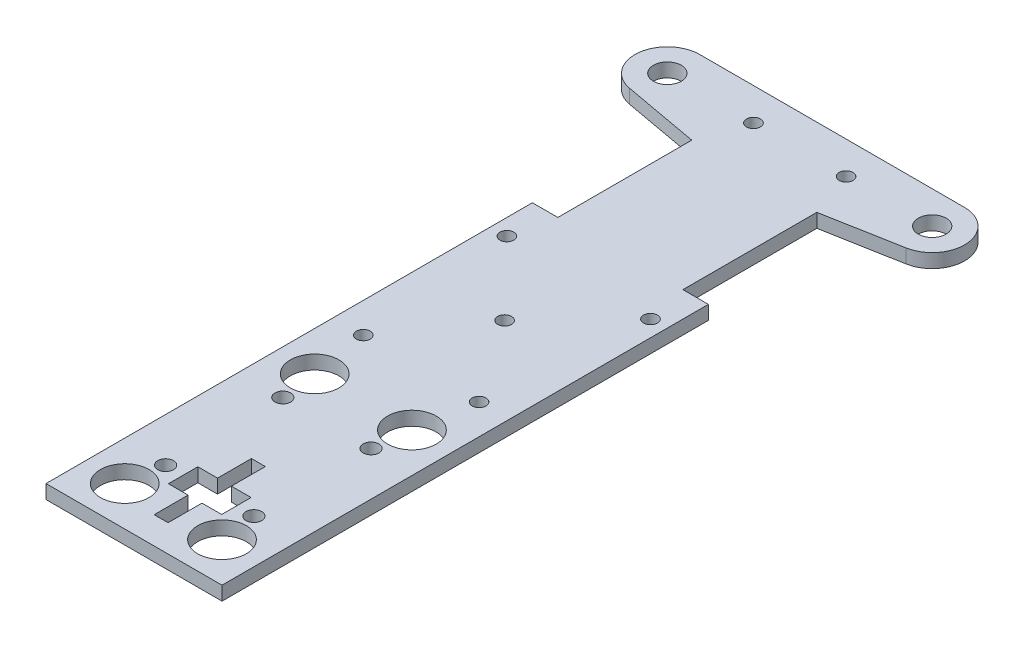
from build123d import *

# Parameters (mm, degrees)
CROQUIS1_W                 = 32
CROQUIS1_H                 = 52
CROQUIS1_R                 = 4
SALIENTE_EXTRUIR1_DEPTH    = 3
CROQUIS2_W                 = 32
CROQUIS2_H                 = 3
SALIENTE_EXTRUIR2_DEPTH    = 50
CORTAR_EXTRUIR1_DEPTH      = 107.943910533
CORTAR_EXTRUIR1_DEPTH_BACK = 107.943910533
CROQUIS3_W                 = 11.5
CROQUIS3_H                 = 6.35
CORTAR_EXTRUIR2_DEPTH      = 107.943910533
CORTAR_EXTRUIR2_DEPTH_BACK = 107.943910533
CROQUIS4_R                 = 1.7
CORTAR_EXTRUIR3_DEPTH      = 107.943910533
CORTAR_EXTRUIR3_DEPTH_BACK = 107.943910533
CROQUIS5_W                 = 3
CROQUIS5_H                 = 21
CORTAR_EXTRUIR4_DEPTH      = 107.943910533
CORTAR_EXTRUIR4_DEPTH_BACK = 107.943910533
CROQUIS6_R                 = 1.7
CORTAR_EXTRUIR5_DEPTH      = 107.943910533
CORTAR_EXTRUIR5_DEPTH_BACK = 107.943910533
CROQUIS7_R                 = 1.5
CROQUIS8_W                 = 49
CROQUIS8_H                 = 3
SALIENTE_EXTRUIR3_DEPTH    = 3
CROQUIS9_W                 = 27
CROQUIS9_H                 = 25
SALIENTE_EXTRUIR4_DEPTH    = 3
CROQUIS10_R                = 3.000000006
CROQUIS10_R_2              = 3
SALIENTE_EXTRUIR5_DEPTH    = 3
CORTAR_EXTRUIR6_DEPTH      = 154.996132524
CORTAR_EXTRUIR6_DEPTH_BACK = 154.996132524
CROQUIS12_R                = 1.5
SALIENTE_EXTRUIR6_START    = -3
CROQUIS14_R                = 3.000000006
CROQUIS14_R_2              = 3
SALIENTE_EXTRUIR6_DEPTH    = 3
CORTAR_EXTRUIR7_DEPTH      = 157.537789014
CORTAR_EXTRUIR7_DEPTH_BACK = 157.537789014
CROQUIS15_R                = 1.5
CROQUIS16_W                = 3
CROQUIS16_H                = 3
SALIENTE_EXTRUIR7_DEPTH    = 56
CROQUIS17_W                = 32
CROQUIS17_H                = 3
SALIENTE_EXTRUIR8_DEPTH    = 3
CORTAR_EXTRUIR8_DEPTH      = 157.537789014
CORTAR_EXTRUIR8_DEPTH_BACK = 157.537789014
CROQUIS18_R                = 5.25


with BuildPart() as part:
    # Croquis1 → Saliente-Extruir1 (new body)
    with BuildSketch(Plane(origin=(0, 0, 0), x_dir=(1, 0, 0), z_dir=(0, 1, 0))):
        with Locations((16, 26)):
            Rectangle(CROQUIS1_W, CROQUIS1_H)
        with Locations(Location((26.5, 46.5, 0), (0, 0, 270))):
            Circle(CROQUIS1_R, mode=Mode.SUBTRACT)
        with Locations(Location((26.5, 5.5, 0), (0, 0, 270))):
            Circle(CROQUIS1_R, mode=Mode.SUBTRACT)
        with Locations(Location((5.5, 5.5, 0), (0, 0, 90))):
            Circle(CROQUIS1_R, mode=Mode.SUBTRACT)
        with Locations(Location((5.5, 46.5, 0), (0, 0, 90))):
            Circle(CROQUIS1_R, mode=Mode.SUBTRACT)
    extrude(amount=SALIENTE_EXTRUIR1_DEPTH)

    # Croquis2 → Saliente-Extruir2 (add)
    with BuildSketch(Plane(origin=(0, 0, -52), x_dir=(-1, 0, 0), z_dir=(0, 0, -1))):
        with Locations((-16, 1.5)):
            Rectangle(CROQUIS2_W, CROQUIS2_H)
    extrude(amount=SALIENTE_EXTRUIR2_DEPTH)

    # Croquis3 → Cortar-Extruir1 (cut, two sides: drawn at the far end of the back side and taken through both)
    with BuildSketch(Plane(origin=(0, 3, 0), x_dir=(1, 0, 0), z_dir=(0, 1, 0)).offset(-CORTAR_EXTRUIR1_DEPTH_BACK)):
        with Locations((16, 13.352394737)):
            Rectangle(CROQUIS3_W, CROQUIS3_H)
    extrude(amount=CORTAR_EXTRUIR1_DEPTH + CORTAR_EXTRUIR1_DEPTH_BACK, mode=Mode.SUBTRACT)

    # Croquis4 → Cortar-Extruir2 (cut, two sides: drawn at the far end of the back side and taken through both)
    with BuildSketch(Plane.XZ.offset(-CORTAR_EXTRUIR2_DEPTH_BACK)):
        with Locations(Location((25.525, -13.352394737, 0), (0, 0, 270))):
            Circle(CROQUIS4_R)
        with Locations(Location((6.475, -13.352394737, 0), (0, 0, 270))):
            Circle(CROQUIS4_R)
    extrude(amount=CORTAR_EXTRUIR2_DEPTH + CORTAR_EXTRUIR2_DEPTH_BACK, mode=Mode.SUBTRACT)

    # Croquis5 → Cortar-Extruir3 (cut, two sides: drawn at the far end of the back side and taken through both)
    with BuildSketch(Plane(origin=(0, 3, 0), x_dir=(1, 0, 0), z_dir=(0, 1, 0)).offset(-CORTAR_EXTRUIR3_DEPTH_BACK)):
        with Locations((16, 13.352394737)):
            Rectangle(CROQUIS5_W, CROQUIS5_H)
    extrude(amount=CORTAR_EXTRUIR3_DEPTH + CORTAR_EXTRUIR3_DEPTH_BACK, mode=Mode.SUBTRACT)

    # Croquis6 → Cortar-Extruir4 (cut, two sides: drawn at the far end of the back side and taken through both)
    with BuildSketch(Plane(origin=(0, 3, 0), x_dir=(1, 0, 0), z_dir=(0, 1, 0)).offset(-CORTAR_EXTRUIR4_DEPTH_BACK)):
        with Locations(Location((25.525, 13.352394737, 0), (0, 0, 90))):
            Circle(CROQUIS6_R)
        with Locations(Location((6.475, 13.352394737, 0), (0, 0, 90))):
            Circle(CROQUIS6_R)
        with Locations(Location((25.525, 38.647605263, 0), (0, 0, 270))):
            Circle(CROQUIS6_R)
        with Locations(Location((6.475, 38.647605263, 0), (0, 0, 270))):
            Circle(CROQUIS6_R)
    extrude(amount=CORTAR_EXTRUIR4_DEPTH + CORTAR_EXTRUIR4_DEPTH_BACK, mode=Mode.SUBTRACT)

    # Croquis7 → Cortar-Extruir5 (cut, two sides: drawn at the far end of the back side and taken through both)
    with BuildSketch(Plane(origin=(0, 3, 0), x_dir=(1, 0, 0), z_dir=(0, 1, 0)).offset(-CORTAR_EXTRUIR5_DEPTH_BACK)):
        with Locations(Location((3.5, 59, 0), (0, 0, 270))):
            Circle(CROQUIS7_R)
        with Locations(Location((28.5, 59, 0), (0, 0, 270))):
            Circle(CROQUIS7_R)
    extrude(amount=CORTAR_EXTRUIR5_DEPTH + CORTAR_EXTRUIR5_DEPTH_BACK, mode=Mode.SUBTRACT)

    # Croquis8 → Saliente-Extruir3 (add)
    with BuildSketch(Plane.ZY):
        with Locations((-77.5, 1.5)):
            Rectangle(CROQUIS8_W, CROQUIS8_H)
    saliente_extruir3 = extrude(amount=SALIENTE_EXTRUIR3_DEPTH)

    # Simetr_a1: Saliente-Extruir3 across plane
    add(saliente_extruir3.mirror(Plane.ZY.offset(-16)))

    # Croquis9 → Saliente-Extruir4 (add)
    with BuildSketch(Plane(origin=(0, 3, 0), x_dir=(1, 0, 0), z_dir=(0, 1, 0))):
        with Locations((16, 114.5)):
            Rectangle(CROQUIS9_W, CROQUIS9_H)
    extrude(amount=-SALIENTE_EXTRUIR4_DEPTH)

    # Croquis10 → Saliente-Extruir5 (add)
    with BuildSketch(Plane.XZ):
        with BuildLine():
            Line((29.5, -127), (29.5, -132.944094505))
            Line((29.5, -132.944094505), (45.437901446, -135.861859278))
            ThreePointArc((45.437901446, -135.861859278), (49.488364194, -141.479445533), (44.040412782, -145.755348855))
            Line((44.040412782, -145.755348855), (-12.637680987, -145.780120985))
            ThreePointArc((-12.637680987, -145.780120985), (-17.619387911, -141.232189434), (-13.538149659, -135.861474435))
            Line((-13.538149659, -135.861474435), (2.5, -132.925754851))
            Line((2.5, -132.925754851), (2.5, -127))
            Line((2.5, -127), (29.5, -127))
        make_face()
        with Locations(Location((-12.639866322, -140.780121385, 0), (0, 0, 270))):
            Circle(CROQUIS10_R, mode=Mode.SUBTRACT)
        with Locations(Location((44.53751123, -140.780120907, 0), (0, 0, 270))):
            Circle(CROQUIS10_R_2, mode=Mode.SUBTRACT)
    extrude(amount=-SALIENTE_EXTRUIR5_DEPTH)

    # Croquis12 → Cortar-Extruir6 (cut, two sides: drawn at the far end of the back side and taken through both)
    with BuildSketch(Plane(origin=(0, 3, 0), x_dir=(1, 0, 0), z_dir=(0, 1, 0)).offset(-CORTAR_EXTRUIR6_DEPTH_BACK)):
        with Locations(Location((31.5, 93, 0), (0, 0, 270))):
            Circle(CROQUIS12_R)
        with Locations(Location((16, 77, 0), (0, 0, 270))):
            Circle(CROQUIS12_R)
        with Locations(Location((0.5, 93, 0), (0, 0, 270))):
            Circle(CROQUIS12_R)
    extrude(amount=CORTAR_EXTRUIR6_DEPTH + CORTAR_EXTRUIR6_DEPTH_BACK, mode=Mode.SUBTRACT)

    # Croquis14 → Saliente-Extruir6 (add)
    with BuildSketch(Plane(origin=(0, 3, 0), x_dir=(1, 0, 0), z_dir=(0, 1, 0)).offset(SALIENTE_EXTRUIR6_START)):
        with BuildLine():
            Line((-12.639866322, 147.780121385), (44.53751123, 147.780121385))
            ThreePointArc((44.53751123, 147.780121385), (51.508844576, 141.412985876), (45.798057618, 133.894554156))
            Line((45.798057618, 133.894554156), (29.5, 130.910855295))
            Line((29.5, 130.910855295), (2.5, 130.910855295))
            Line((2.5, 130.910855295), (-13.892796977, 133.893165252))
            ThreePointArc((-13.892796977, 133.893165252), (-19.611548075, 141.409131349), (-12.639866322, 147.780121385))
        make_face()
        with Locations(Location((-12.639866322, 140.780121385, 0), (0, 0, 90))):
            Circle(CROQUIS14_R, mode=Mode.SUBTRACT)
        with Locations(Location((44.53751123, 140.780120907, 0), (0, 0, 90))):
            Circle(CROQUIS14_R_2, mode=Mode.SUBTRACT)
    extrude(amount=SALIENTE_EXTRUIR6_DEPTH)

    # Croquis15 → Cortar-Extruir7 (cut, two sides: drawn at the far end of the back side and taken through both)
    with BuildSketch(Plane(origin=(0, 3, 0), x_dir=(1, 0, 0), z_dir=(0, 1, 0)).offset(-CORTAR_EXTRUIR7_DEPTH_BACK)):
        with Locations(Location((5.949911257, 140.780133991, 0), (0, 0, 270))):
            Circle(CROQUIS15_R)
        with Locations(Location((25.949911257, 140.78012721, 0), (0, 0, 270))):
            Circle(CROQUIS15_R)
    extrude(amount=CORTAR_EXTRUIR7_DEPTH + CORTAR_EXTRUIR7_DEPTH_BACK, mode=Mode.SUBTRACT)

    # Croquis16 → Saliente-Extruir7 (add)
    with BuildSketch(Plane.XY.offset(-53)):
        with Locations((33.5, 1.5)):
            Rectangle(CROQUIS16_W, CROQUIS16_H)
        with Locations((-1.5, 1.5)):
            Rectangle(CROQUIS16_W, CROQUIS16_H)
    extrude(amount=SALIENTE_EXTRUIR7_DEPTH)

    # Croquis17 → Saliente-Extruir8 (add)
    with BuildSketch(Plane.XY):
        with Locations((16, 1.5)):
            Rectangle(CROQUIS17_W, CROQUIS17_H)
    extrude(amount=SALIENTE_EXTRUIR8_DEPTH)

    # Croquis18 → Cortar-Extruir8 (cut, two sides: drawn at the far end of the back side and taken through both)
    with BuildSketch(Plane(origin=(0, 3, 0), x_dir=(1, 0, 0), z_dir=(0, 1, 0)).offset(-CORTAR_EXTRUIR8_DEPTH_BACK)):
        with Locations(Location((5.5, 46.5, 0), (0, 0, 270))):
            Circle(CROQUIS18_R)
        with Locations(Location((26.5, 46.5, 0), (0, 0, 270))):
            Circle(CROQUIS18_R)
        with Locations(Location((26.5, 5.5, 0), (0, 0, 270))):
            Circle(CROQUIS18_R)
        with Locations(Location((5.5, 5.5, 0), (0, 0, 270))):
            Circle(CROQUIS18_R)
    extrude(amount=CORTAR_EXTRUIR8_DEPTH + CORTAR_EXTRUIR8_DEPTH_BACK, mode=Mode.SUBTRACT)


solid = part.part
